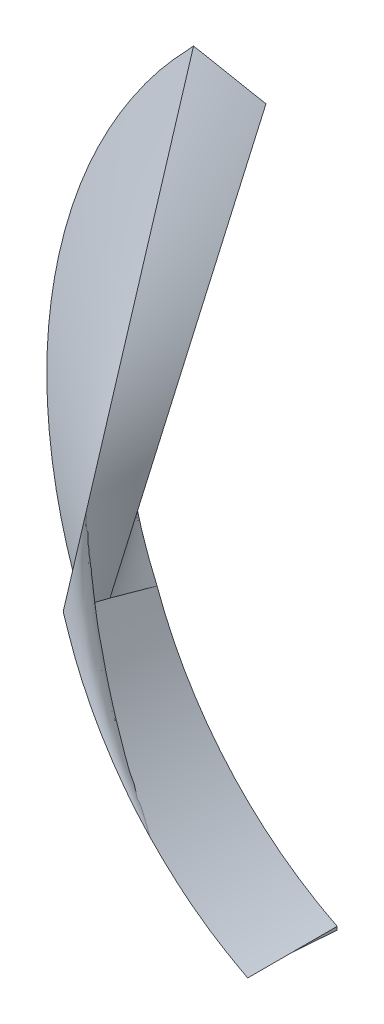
ISO-10303-21;
HEADER;
FILE_DESCRIPTION(('STEP AP214'),'2;1');
FILE_NAME('part.step','',(''),(''),'','','');
FILE_SCHEMA(('AUTOMOTIVE_DESIGN { 1 0 10303 214 1 1 1 1 }'));
ENDSEC;
DATA;
#1=APPLICATION_CONTEXT('core data for automotive mechanical design processes');
#2=APPLICATION_PROTOCOL_DEFINITION('international standard','automotive_design',2000,#1);
#3=PRODUCT_CONTEXT('',#1,'mechanical');
#4=PRODUCT('Part','Part','',(#3));
#5=PRODUCT_RELATED_PRODUCT_CATEGORY('part','',(#4));
#6=PRODUCT_DEFINITION_FORMATION('','',#4);
#7=PRODUCT_DEFINITION_CONTEXT('part definition',#1,'design');
#8=PRODUCT_DEFINITION('design','',#6,#7);
#9=PRODUCT_DEFINITION_SHAPE('','',#8);
#10=(LENGTH_UNIT() NAMED_UNIT(*) SI_UNIT(.MILLI.,.METRE.));
#11=(NAMED_UNIT(*) PLANE_ANGLE_UNIT() SI_UNIT($,.RADIAN.));
#12=(NAMED_UNIT(*) SI_UNIT($,.STERADIAN.) SOLID_ANGLE_UNIT());
#13=UNCERTAINTY_MEASURE_WITH_UNIT(LENGTH_MEASURE(1.E-05),#10,'distance_accuracy_value','');
#14=(GEOMETRIC_REPRESENTATION_CONTEXT(3) GLOBAL_UNCERTAINTY_ASSIGNED_CONTEXT((#13)) GLOBAL_UNIT_ASSIGNED_CONTEXT((#10,
#11,#12)) REPRESENTATION_CONTEXT('',''));
#15=CARTESIAN_POINT('',(0.,0.,0.));
#16=DIRECTION('',(0.,0.,1.));
#17=DIRECTION('',(1.,0.,0.));
#18=AXIS2_PLACEMENT_3D('',#15,#16,#17);
#19=CARTESIAN_POINT('',(-28.2525641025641,-60.4671431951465,22.6547696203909));
#20=DIRECTION('',(0.,0.,-1.));
#21=DIRECTION('',(-1.,0.,0.));
#22=AXIS2_PLACEMENT_3D('',#19,#20,#21);
#23=CYLINDRICAL_SURFACE('',#22,17.5);
#24=CARTESIAN_POINT('',(-35.7525641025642,-76.2785314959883,7.35833424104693));
#25=DIRECTION('',(0.,0.,-1.));
#26=VECTOR('',#25,1.);
#27=LINE('',#24,#26);
#28=CARTESIAN_POINT('',(-35.7525641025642,-76.2785314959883,7.35833424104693));
#29=VERTEX_POINT('',#28);
#30=CARTESIAN_POINT('',(-35.7525641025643,-76.2785314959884,5.28894384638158));
#31=VERTEX_POINT('',#30);
#32=EDGE_CURVE('E137',#29,#31,#27,.T.);
#33=ORIENTED_EDGE('',*,*,#32,.T.);
#34=CARTESIAN_POINT('',(-28.2525641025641,-60.4671431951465,4.69415557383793));
#35=DIRECTION('',(0.,0.03759112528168,0.999293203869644));
#36=DIRECTION('',(0.,0.999293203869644,-0.03759112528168));
#37=AXIS2_PLACEMENT_3D('',#34,#35,#36);
#38=ELLIPSE('',#37,17.5123776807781,17.5);
#39=CARTESIAN_POINT('',(-44.4232075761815,-67.157456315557,4.94582985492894));
#40=VERTEX_POINT('',#39);
#41=EDGE_CURVE('E147',#40,#31,#38,.T.);
#42=ORIENTED_EDGE('',*,*,#41,.F.);
#43=CARTESIAN_POINT('',(-44.5950370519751,-66.7261290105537,6.95222047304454));
#44=CARTESIAN_POINT('',(-44.5774687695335,-66.7720009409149,6.72874549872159));
#45=CARTESIAN_POINT('',(-44.5413787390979,-66.8650621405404,6.28214180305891));
#46=CARTESIAN_POINT('',(-44.4841959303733,-67.0087605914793,5.61332162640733));
#47=CARTESIAN_POINT('',(-44.4439173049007,-67.1074004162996,5.16819615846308));
#48=CARTESIAN_POINT('',(-44.4232075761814,-67.1574563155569,4.94582985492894));
#49=B_SPLINE_CURVE_WITH_KNOTS('',3,(#43,#44,#45,#46,#47,#48),.UNSPECIFIED.,.F.,.F.,(4,1,1,4),
(0.5,0.666666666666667,0.833333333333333,1.),.UNSPECIFIED.);
#50=CARTESIAN_POINT('',(-44.5950193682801,-66.7261222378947,6.95222047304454));
#51=VERTEX_POINT('',#50);
#52=EDGE_CURVE('E258',#51,#40,#49,.T.);
#53=ORIENTED_EDGE('',*,*,#52,.F.);
#54=CARTESIAN_POINT('',(-44.7411229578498,-66.3303698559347,8.96795992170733));
#55=CARTESIAN_POINT('',(-44.7261340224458,-66.3725217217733,8.74351610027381));
#56=CARTESIAN_POINT('',(-44.6953900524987,-66.4579881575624,8.29492810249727));
#57=CARTESIAN_POINT('',(-44.6467884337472,-66.5898305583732,7.62299164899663));
#58=CARTESIAN_POINT('',(-44.6126053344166,-66.6802570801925,7.1756954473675));
#59=CARTESIAN_POINT('',(-44.5950370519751,-66.7261290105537,6.95222047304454));
#60=B_SPLINE_CURVE_WITH_KNOTS('',3,(#54,#55,#56,#57,#58,#59),.UNSPECIFIED.,.F.,.F.,(4,1,1,4),
(0.,0.166666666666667,0.333333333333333,0.5),.UNSPECIFIED.);
#61=CARTESIAN_POINT('',(-44.7411229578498,-66.3303698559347,8.96795992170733));
#62=VERTEX_POINT('',#61);
#63=EDGE_CURVE('E282',#62,#51,#60,.T.);
#64=ORIENTED_EDGE('',*,*,#63,.F.);
#65=CARTESIAN_POINT('',(-35.7525641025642,-76.2785314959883,9.42772463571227));
#66=CARTESIAN_POINT('',(-36.0030285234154,-76.1508503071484,9.42182371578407));
#67=CARTESIAN_POINT('',(-36.5157903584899,-75.8894557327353,9.40974309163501));
#68=CARTESIAN_POINT('',(-37.2719991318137,-75.4727841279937,9.3904861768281));
#69=CARTESIAN_POINT('',(-37.8240856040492,-75.1209371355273,9.37422519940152));
#70=CARTESIAN_POINT('',(-38.1745551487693,-74.8812334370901,9.36314704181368));
#71=CARTESIAN_POINT('',(-38.3402314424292,-74.7650066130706,9.35777549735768));
#72=CARTESIAN_POINT('',(-38.5047807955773,-74.6467443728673,9.35230988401));
#73=CARTESIAN_POINT('',(-38.8454268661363,-74.3961909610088,9.34073029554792));
#74=CARTESIAN_POINT('',(-39.3536967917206,-74.0001261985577,9.32242574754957));
#75=CARTESIAN_POINT('',(-39.9019610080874,-73.5292817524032,9.30066517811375));
#76=CARTESIAN_POINT('',(-40.3269605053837,-73.1354720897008,9.28246485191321));
#77=CARTESIAN_POINT('',(-40.6384707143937,-72.8318758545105,9.26843383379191));
#78=CARTESIAN_POINT('',(-40.9425743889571,-72.5201088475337,9.25402519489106));
#79=CARTESIAN_POINT('',(-41.2387078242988,-72.2006497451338,9.23926105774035));
#80=CARTESIAN_POINT('',(-41.5266619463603,-71.8735984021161,9.22414603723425));
#81=CARTESIAN_POINT('',(-41.8059994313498,-71.5395299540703,9.20870671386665));
#82=CARTESIAN_POINT('',(-42.0766255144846,-71.1987724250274,9.19295824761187));
#83=CARTESIAN_POINT('',(-42.4256072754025,-70.7362820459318,9.17158377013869));
#84=CARTESIAN_POINT('',(-42.8388141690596,-70.1429692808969,9.14416319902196));
#85=CARTESIAN_POINT('',(-43.1812570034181,-69.59740600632,9.11894942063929));
#86=CARTESIAN_POINT('',(-43.3960555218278,-69.2331648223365,9.10211563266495));
#87=CARTESIAN_POINT('',(-43.4969133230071,-69.057775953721,9.09400985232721));
#88=CARTESIAN_POINT('',(-43.604161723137,-68.8662541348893,9.08515847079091));
#89=CARTESIAN_POINT('',(-43.8132464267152,-68.4809028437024,9.06734905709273));
#90=CARTESIAN_POINT('',(-44.1054485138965,-67.8953705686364,9.04028806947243));
#91=CARTESIAN_POINT('',(-44.4361401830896,-67.1162192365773,9.00427877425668));
#92=CARTESIAN_POINT('',(-44.639444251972,-66.5923654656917,8.98006832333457));
#93=CARTESIAN_POINT('',(-44.7411229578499,-66.3303698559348,8.96795992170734));
#94=B_SPLINE_CURVE_WITH_KNOTS('',3,(#65,#66,#67,#68,#69,#70,#71,#72,#73,#74,#75,#76,#77,#78,#79,
#80,#81,#82,#83,#84,#85,#86,#87,#88,#89,#90,#91,#92,#93),.UNSPECIFIED.,.F.,.F.,(4,1,1,1,1,1,1,1,
1,1,1,1,1,1,1,1,1,1,1,1,1,1,1,1,1,1,4),(0.,0.0625220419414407,0.127997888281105,
0.191230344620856,0.205922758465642,0.220615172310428,0.235307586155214,0.25,0.3125,0.375,
0.406216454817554,0.4375,0.468738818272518,0.5,0.531261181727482,0.562522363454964,
0.593783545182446,0.625044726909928,0.6875,0.750068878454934,0.764692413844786,
0.779384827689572,0.794077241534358,0.8125,0.875032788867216,0.9375,1.),.UNSPECIFIED.);
#95=CARTESIAN_POINT('',(-35.7525641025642,-76.2785314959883,9.42772463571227));
#96=VERTEX_POINT('',#95);
#97=EDGE_CURVE('E123',#96,#62,#94,.T.);
#98=ORIENTED_EDGE('',*,*,#97,.F.);
#99=CARTESIAN_POINT('',(-35.7525641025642,-76.2785314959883,7.35833424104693));
#100=CARTESIAN_POINT('',(-35.7525641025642,-76.2785314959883,7.58826650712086));
#101=CARTESIAN_POINT('',(-35.7525641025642,-76.2785314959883,8.04813103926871));
#102=CARTESIAN_POINT('',(-35.7525641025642,-76.2785314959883,8.73792783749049));
#103=CARTESIAN_POINT('',(-35.7525641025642,-76.2785314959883,9.19779236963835));
#104=CARTESIAN_POINT('',(-35.7525641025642,-76.2785314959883,9.42772463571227));
#105=B_SPLINE_CURVE_WITH_KNOTS('',3,(#99,#100,#101,#102,#103,#104),.UNSPECIFIED.,.F.,.F.,(4,1,1,
4),(0.,0.166666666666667,0.333333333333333,0.5),.UNSPECIFIED.);
#106=EDGE_CURVE('E141',#96,#29,#105,.F.);
#107=ORIENTED_EDGE('',*,*,#106,.T.);
#108=EDGE_LOOP('',(#33,#42,#53,#64,#98,#107));
#109=FACE_BOUND('',#108,.T.);
#110=ADVANCED_FACE('F103',(#109),#23,.F.);
#111=CARTESIAN_POINT('',(-35.7525641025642,-76.2785314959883,9.42772463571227));
#112=CARTESIAN_POINT('',(-35.7525641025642,-76.2785314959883,9.19779236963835));
#113=CARTESIAN_POINT('',(-35.7525641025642,-76.2785314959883,8.73792783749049));
#114=CARTESIAN_POINT('',(-35.7525641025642,-76.2785314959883,8.04813103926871));
#115=CARTESIAN_POINT('',(-35.7525641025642,-76.2785314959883,7.58826650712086));
#116=CARTESIAN_POINT('',(-35.7525641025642,-76.2785314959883,7.35833424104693));
#117=CARTESIAN_POINT('',(-42.8181753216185,-76.4318356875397,5.29471079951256));
#118=CARTESIAN_POINT('',(-42.0331074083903,-76.4318356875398,5.29471079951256));
#119=CARTESIAN_POINT('',(-40.4629715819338,-76.4318356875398,5.29471079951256));
#120=CARTESIAN_POINT('',(-38.107767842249,-76.4318356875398,5.29471079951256));
#121=CARTESIAN_POINT('',(-36.5376320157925,-76.4318356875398,5.29471079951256));
#122=CARTESIAN_POINT('',(-35.7525641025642,-76.4318356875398,5.29471079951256));
#123=B_SPLINE_SURFACE_WITH_KNOTS('',1,3,((#111,#112,#113,#114,#115,#116),(#117,#118,#119,#120,
#121,#122)),.UNSPECIFIED.,.F.,.F.,.F.,(2,2),(4,1,1,4),(0.,1.),(0.,0.166666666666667,
0.333333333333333,0.5),.UNSPECIFIED.);
#124=DIRECTION('',(0.863020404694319,0.0187251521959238,0.504821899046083));
#125=VECTOR('',#124,1.);
#126=CARTESIAN_POINT('',(-39.2853697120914,-76.355183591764,7.36121771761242));
#127=LINE('',#126,#125);
#128=CARTESIAN_POINT('',(-42.8181753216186,-76.4318356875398,5.29471079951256));
#129=VERTEX_POINT('',#128);
#130=EDGE_CURVE('E377',#129,#96,#127,.T.);
#131=CARTESIAN_POINT('',(-42.8181753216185,-76.4318356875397,5.29471079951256));
#132=CARTESIAN_POINT('',(-42.0331074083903,-76.4318356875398,5.29471079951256));
#133=CARTESIAN_POINT('',(-40.4629715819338,-76.4318356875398,5.29471079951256));
#134=CARTESIAN_POINT('',(-38.107767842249,-76.4318356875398,5.29471079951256));
#135=CARTESIAN_POINT('',(-36.5376320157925,-76.4318356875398,5.29471079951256));
#136=CARTESIAN_POINT('',(-35.7525641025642,-76.4318356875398,5.29471079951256));
#137=B_SPLINE_CURVE_WITH_KNOTS('',3,(#131,#132,#133,#134,#135,#136),.UNSPECIFIED.,.F.,.F.,(4,1,
1,4),(0.,0.166666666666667,0.333333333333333,0.5),.UNSPECIFIED.);
#138=CARTESIAN_POINT('',(-35.7525641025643,-76.4318356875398,5.29471079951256));
#139=VERTEX_POINT('',#138);
#140=EDGE_CURVE('E164',#129,#139,#137,.T.);
#141=CARTESIAN_POINT('',(-35.7525641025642,-76.4318356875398,5.29471079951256));
#142=CARTESIAN_POINT('',(-35.7525641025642,-76.2785314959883,7.35833424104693));
#143=B_SPLINE_CURVE_WITH_KNOTS('',1,(#141,#142),.UNSPECIFIED.,.F.,.F.,(2,2),(0.,1.),.UNSPECIFIED.);
#144=EDGE_CURVE('E153',#29,#139,#143,.F.);
#145=ORIENTED_EDGE('',*,*,#130,.F.);
#146=ORIENTED_EDGE('',*,*,#140,.T.);
#147=ORIENTED_EDGE('',*,*,#144,.F.);
#148=ORIENTED_EDGE('',*,*,#106,.F.);
#149=EDGE_LOOP('',(#145,#146,#147,#148));
#150=FACE_BOUND('',#149,.T.);
#151=ADVANCED_FACE('F162',(#150),#123,.T.);
#152=CARTESIAN_POINT('',(-35.7525641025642,-76.2785314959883,7.35833424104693));
#153=DIRECTION('',(1.,0.,0.));
#154=DIRECTION('',(0.,-0.0740846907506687,-0.997251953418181));
#155=AXIS2_PLACEMENT_3D('',#152,#153,#154);
#156=PLANE('',#155);
#157=ORIENTED_EDGE('',*,*,#144,.T.);
#158=CARTESIAN_POINT('',(-35.7525641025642,-76.4318356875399,5.29471079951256));
#159=DIRECTION('',(0.,0.999293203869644,-0.0375911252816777));
#160=VECTOR('',#159,1.);
#161=LINE('',#158,#160);
#162=EDGE_CURVE('E156',#139,#31,#161,.T.);
#163=ORIENTED_EDGE('',*,*,#162,.T.);
#164=ORIENTED_EDGE('',*,*,#32,.F.);
#165=EDGE_LOOP('',(#157,#163,#164));
#166=FACE_BOUND('',#165,.T.);
#167=ADVANCED_FACE('F105',(#166),#156,.T.);
#168=CARTESIAN_POINT('',(19.3167969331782,144.825406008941,-3.0284806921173));
#169=DIRECTION('',(0.,0.03759112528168,0.999293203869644));
#170=DIRECTION('',(0.,-0.999293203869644,0.03759112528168));
#171=AXIS2_PLACEMENT_3D('',#168,#169,#170);
#172=PLANE('',#171);
#173=CARTESIAN_POINT('',(-43.5512841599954,-45.5112452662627,4.13154889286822));
#174=CARTESIAN_POINT('',(-43.7072568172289,-45.6777455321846,4.13781225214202));
#175=CARTESIAN_POINT('',(-43.8632202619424,-45.8443284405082,4.144078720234));
#176=CARTESIAN_POINT('',(-44.1727621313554,-46.1798571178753,4.15670054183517));
#177=CARTESIAN_POINT('',(-44.3263391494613,-46.3488041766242,4.16305594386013));
#178=CARTESIAN_POINT('',(-44.5530568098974,-46.6055667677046,4.17271476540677));
#179=CARTESIAN_POINT('',(-44.6280470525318,-46.6917421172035,4.17595648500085));
#180=CARTESIAN_POINT('',(-44.7764774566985,-46.8654157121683,4.18248968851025));
#181=CARTESIAN_POINT('',(-44.8499176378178,-46.9529139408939,4.18578117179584));
#182=CARTESIAN_POINT('',(-44.9950132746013,-47.1293386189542,4.19241786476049));
#183=CARTESIAN_POINT('',(-45.0666691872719,-47.2182646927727,4.19576306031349));
#184=CARTESIAN_POINT('',(-45.2083181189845,-47.397429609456,4.20250283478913));
#185=CARTESIAN_POINT('',(-45.2783111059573,-47.4876684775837,4.20589741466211));
#186=CARTESIAN_POINT('',(-45.4859167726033,-47.7602742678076,4.21615222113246));
#187=CARTESIAN_POINT('',(-45.6211169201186,-47.9444824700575,4.22308171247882));
#188=CARTESIAN_POINT('',(-45.8855924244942,-48.3171329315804,4.23709997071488));
#189=CARTESIAN_POINT('',(-46.014866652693,-48.5055759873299,4.24418876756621));
#190=CARTESIAN_POINT('',(-46.267810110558,-48.8862041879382,4.25850713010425));
#191=CARTESIAN_POINT('',(-46.3914789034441,-49.0783896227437,4.2657367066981));
#192=CARTESIAN_POINT('',(-46.6328514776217,-49.4664417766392,4.28033434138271));
#193=CARTESIAN_POINT('',(-46.7505558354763,-49.6623081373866,4.28770238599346));
#194=CARTESIAN_POINT('',(-46.9797297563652,-50.0576197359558,4.30257310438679));
#195=CARTESIAN_POINT('',(-47.0912001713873,-50.2570644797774,4.31007575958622));
#196=CARTESIAN_POINT('',(-47.3076585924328,-50.6594391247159,4.32521217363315));
#197=CARTESIAN_POINT('',(-47.4126462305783,-50.8623692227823,4.33284593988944));
#198=CARTESIAN_POINT('',(-47.7176311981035,-51.4759733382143,4.35592832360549));
#199=CARTESIAN_POINT('',(-47.9077455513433,-51.891624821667,4.37156418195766));
#200=CARTESIAN_POINT('',(-48.2098995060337,-52.6139807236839,4.39873755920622));
#201=CARTESIAN_POINT('',(-48.3287259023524,-52.9178790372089,4.41016951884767));
#202=CARTESIAN_POINT('',(-48.5522793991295,-53.5308168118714,4.43322683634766));
#203=CARTESIAN_POINT('',(-48.6570053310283,-53.839856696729,4.4448522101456));
#204=CARTESIAN_POINT('',(-48.9499515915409,-54.7738063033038,4.4799852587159));
#205=CARTESIAN_POINT('',(-49.1169440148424,-55.4055546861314,4.50375018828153));
#206=CARTESIAN_POINT('',(-49.3245277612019,-56.3612909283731,4.5397028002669));
#207=CARTESIAN_POINT('',(-49.386523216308,-56.6808373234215,4.55172340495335));
#208=CARTESIAN_POINT('',(-49.4962669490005,-57.32237499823,4.57585658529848));
#209=CARTESIAN_POINT('',(-49.5440147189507,-57.644366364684,4.58796916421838));
#210=CARTESIAN_POINT('',(-49.6655205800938,-58.6127278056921,4.62439670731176));
#211=CARTESIAN_POINT('',(-49.7176560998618,-59.2620133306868,4.64882134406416));
#212=CARTESIAN_POINT('',(-49.7502217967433,-60.2115584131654,4.68454105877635));
#213=CARTESIAN_POINT('',(-49.7541588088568,-60.5112185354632,4.69581358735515));
#214=CARTESIAN_POINT('',(-49.7490576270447,-61.1103827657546,4.71835277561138));
#215=CARTESIAN_POINT('',(-49.7400227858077,-61.4098868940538,4.72961943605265));
#216=CARTESIAN_POINT('',(-49.7090927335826,-62.0082183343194,4.75212729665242));
#217=CARTESIAN_POINT('',(-49.6871977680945,-62.3070456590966,4.76336849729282));
#218=CARTESIAN_POINT('',(-49.6308567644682,-62.903577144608,4.78580864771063));
#219=CARTESIAN_POINT('',(-49.5964074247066,-63.2012809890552,4.79700758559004));
#220=CARTESIAN_POINT('',(-49.4735187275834,-64.0993513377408,4.83079093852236));
#221=CARTESIAN_POINT('',(-49.3659313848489,-64.6972007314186,4.85328066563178));
#222=CARTESIAN_POINT('',(-49.1016267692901,-65.8821713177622,4.89785654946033));
#223=CARTESIAN_POINT('',(-48.9448917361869,-66.4692885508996,4.91994255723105));
#224=CARTESIAN_POINT('',(-48.6733846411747,-67.3391219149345,4.95266369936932));
#225=CARTESIAN_POINT('',(-48.5766872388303,-67.6275733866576,4.96351458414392));
#226=CARTESIAN_POINT('',(-48.3711608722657,-68.2001520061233,4.98505368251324));
#227=CARTESIAN_POINT('',(-48.2623318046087,-68.4842791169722,4.99574189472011));
#228=CARTESIAN_POINT('',(-48.0326045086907,-69.0475769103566,5.01693186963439));
#229=CARTESIAN_POINT('',(-47.9117077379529,-69.3267481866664,5.02743365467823));
#230=CARTESIAN_POINT('',(-47.657743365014,-69.8794979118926,5.04822683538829));
#231=CARTESIAN_POINT('',(-47.5246764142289,-70.1530766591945,5.05851824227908));
#232=CARTESIAN_POINT('',(-47.2896044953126,-70.6110987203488,5.0757479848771));
#233=CARTESIAN_POINT('',(-47.1906197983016,-70.7970989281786,5.08274488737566));
#234=CARTESIAN_POINT('',(-46.9872197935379,-71.1661050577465,5.09662605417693));
#235=CARTESIAN_POINT('',(-46.8828047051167,-71.3491111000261,5.10351032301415));
#236=CARTESIAN_POINT('',(-46.6685261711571,-71.7119597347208,5.11715985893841));
#237=CARTESIAN_POINT('',(-46.558661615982,-71.8918016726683,5.1239251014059));
#238=CARTESIAN_POINT('',(-46.3336866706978,-72.248173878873,5.13733100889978));
#239=CARTESIAN_POINT('',(-46.2185763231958,-72.4247041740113,5.1439716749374));
#240=CARTESIAN_POINT('',(-45.983358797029,-72.7744220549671,5.15712726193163));
#241=CARTESIAN_POINT('',(-45.8632513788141,-72.9476094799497,5.16364217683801));
#242=CARTESIAN_POINT('',(-45.6795339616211,-73.2048467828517,5.17331885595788));
#243=CARTESIAN_POINT('',(-45.6177011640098,-73.2901698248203,5.1765285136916));
#244=CARTESIAN_POINT('',(-45.4928805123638,-73.4599679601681,5.18291593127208));
#245=CARTESIAN_POINT('',(-45.4298926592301,-73.5444430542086,5.18609369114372));
#246=CARTESIAN_POINT('',(-45.2391109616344,-73.7965664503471,5.19557799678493));
#247=CARTESIAN_POINT('',(-45.1095293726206,-73.9628702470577,5.20183396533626));
#248=CARTESIAN_POINT('',(-44.8453226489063,-74.291389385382,5.2141921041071));
#249=CARTESIAN_POINT('',(-44.7106984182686,-74.4536054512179,5.22029430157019));
#250=CARTESIAN_POINT('',(-44.5047409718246,-74.6934457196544,5.22931654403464));
#251=CARTESIAN_POINT('',(-44.4354248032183,-74.7728047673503,5.23230184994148));
#252=CARTESIAN_POINT('',(-44.2953882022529,-74.9302750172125,5.23822552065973));
#253=CARTESIAN_POINT('',(-44.2246677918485,-75.0083862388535,5.24116388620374));
#254=CARTESIAN_POINT('',(-44.0103842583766,-75.2408329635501,5.24990800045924));
#255=CARTESIAN_POINT('',(-43.8647302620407,-75.3932448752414,5.25564138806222));
#256=CARTESIAN_POINT('',(-43.5698093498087,-75.6943381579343,5.26696782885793));
#257=CARTESIAN_POINT('',(-43.4205443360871,-75.8430214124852,5.27256095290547));
#258=CARTESIAN_POINT('',(-43.1202474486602,-76.138430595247,5.2836735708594));
#259=CARTESIAN_POINT('',(-42.9692166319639,-76.2851575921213,5.28919310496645));
#260=CARTESIAN_POINT('',(-42.8181753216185,-76.4318356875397,5.29471079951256));
#261=B_SPLINE_CURVE_WITH_KNOTS('',3,(#173,#174,#175,#176,#177,#178,#179,#180,#181,#182,#183,
#184,#185,#186,#187,#188,#189,#190,#191,#192,#193,#194,#195,#196,#197,#198,#199,#200,#201,#202,
#203,#204,#205,#206,#207,#208,#209,#210,#211,#212,#213,#214,#215,#216,#217,#218,#219,#220,#221,
#222,#223,#224,#225,#226,#227,#228,#229,#230,#231,#232,#233,#234,#235,#236,#237,#238,#239,#240,
#241,#242,#243,#244,#245,#246,#247,#248,#249,#250,#251,#252,#253,#254,#255,#256,#257,#258,#259,
#260),.UNSPECIFIED.,.F.,.F.,(4,2,2,2,2,2,2,2,2,2,2,2,2,2,2,2,2,2,2,2,2,2,2,2,2,2,2,2,2,2,2,2,2,
2,2,2,2,2,2,2,2,2,2,4),(0.,0.684784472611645,1.36995832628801,1.71278587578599,2.0556090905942,
2.39834357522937,2.7410846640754,3.42675258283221,4.11255055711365,4.79840187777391,
5.48418677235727,6.1698777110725,6.85560752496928,8.22650025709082,9.2056762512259,
10.1849333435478,12.1434193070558,13.1203425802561,14.0973006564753,16.0495998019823,
16.9490905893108,17.848348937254,18.7475901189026,19.6470679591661,21.4684264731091,
23.2904439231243,24.2034816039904,25.1165270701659,26.029462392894,26.9423488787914,
27.5747113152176,28.2070482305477,28.8395144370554,29.4719755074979,30.1044669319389,
30.420722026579,30.736976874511,31.3696436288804,32.002197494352,32.3184168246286,
32.6346312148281,33.2672048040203,33.8994521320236,34.531338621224),.UNSPECIFIED.);
#262=CARTESIAN_POINT('',(-43.5512841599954,-45.5112452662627,4.13154889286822));
#263=VERTEX_POINT('',#262);
#264=EDGE_CURVE('E114',#263,#129,#261,.T.);
#265=ORIENTED_EDGE('',*,*,#264,.F.);
#266=CARTESIAN_POINT('',(-40.1797824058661,-46.1285270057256,4.15476962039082));
#267=CARTESIAN_POINT('',(-40.5543937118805,-46.0599401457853,4.15218953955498));
#268=CARTESIAN_POINT('',(-41.3036163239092,-45.9227664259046,4.14702937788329));
#269=CARTESIAN_POINT('',(-42.4274502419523,-45.7170058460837,4.13928913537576));
#270=CARTESIAN_POINT('',(-43.176672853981,-45.579832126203,4.13412897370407));
#271=CARTESIAN_POINT('',(-43.5512841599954,-45.5112452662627,4.13154889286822));
#272=B_SPLINE_CURVE_WITH_KNOTS('',3,(#266,#267,#268,#269,#270,#271),.UNSPECIFIED.,.F.,.F.,(4,1,
1,4),(0.,0.166666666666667,0.333333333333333,0.5),.UNSPECIFIED.);
#273=CARTESIAN_POINT('',(-40.1797824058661,-46.1285270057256,4.15476962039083));
#274=VERTEX_POINT('',#273);
#275=EDGE_CURVE('E302',#263,#274,#272,.F.);
#276=ORIENTED_EDGE('',*,*,#275,.T.);
#277=CARTESIAN_POINT('',(-44.4232075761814,-67.1574563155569,4.94582985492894));
#278=CARTESIAN_POINT('',(-45.6092464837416,-64.773202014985,4.85613966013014));
#279=CARTESIAN_POINT('',(-46.8022853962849,-59.6696880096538,4.66415713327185));
#280=CARTESIAN_POINT('',(-45.2767825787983,-52.1098302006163,4.37977256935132));
#281=CARTESIAN_POINT('',(-42.1977769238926,-47.867153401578,4.22017276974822));
#282=CARTESIAN_POINT('',(-40.1797824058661,-46.1285270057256,4.15476962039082));
#283=B_SPLINE_CURVE_WITH_KNOTS('',3,(#277,#278,#279,#280,#281,#282),.UNSPECIFIED.,.F.,.F.,(4,1,
1,4),(0.5,0.666666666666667,0.833333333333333,1.),.UNSPECIFIED.);
#284=EDGE_CURVE('E278',#274,#40,#283,.F.);
#285=ORIENTED_EDGE('',*,*,#284,.T.);
#286=ORIENTED_EDGE('',*,*,#41,.T.);
#287=ORIENTED_EDGE('',*,*,#162,.F.);
#288=ORIENTED_EDGE('',*,*,#140,.F.);
#289=EDGE_LOOP('',(#265,#276,#285,#286,#287,#288));
#290=FACE_BOUND('',#289,.T.);
#291=ADVANCED_FACE('F184',(#290),#172,.F.);
#292=CARTESIAN_POINT('',(-44.7411229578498,-66.3303698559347,8.96795992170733));
#293=CARTESIAN_POINT('',(-44.7261340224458,-66.3725217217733,8.74351610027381));
#294=CARTESIAN_POINT('',(-44.6953900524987,-66.4579881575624,8.29492810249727));
#295=CARTESIAN_POINT('',(-44.6467884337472,-66.5898305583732,7.62299164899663));
#296=CARTESIAN_POINT('',(-44.6126053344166,-66.6802570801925,7.1756954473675));
#297=CARTESIAN_POINT('',(-44.5950370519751,-66.7261290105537,6.95222047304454));
#298=CARTESIAN_POINT('',(-43.5512841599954,-45.5112452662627,4.13154889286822));
#299=CARTESIAN_POINT('',(-43.176672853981,-45.579832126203,4.13412897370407));
#300=CARTESIAN_POINT('',(-42.4274502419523,-45.7170058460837,4.13928913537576));
#301=CARTESIAN_POINT('',(-41.3036163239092,-45.9227664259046,4.14702937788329));
#302=CARTESIAN_POINT('',(-40.5543937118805,-46.0599401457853,4.15218953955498));
#303=CARTESIAN_POINT('',(-40.1797824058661,-46.1285270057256,4.15476962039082));
#304=B_SPLINE_SURFACE_WITH_KNOTS('',1,3,((#292,#293,#294,#295,#296,#297),(#298,#299,#300,#301,
#302,#303)),.UNSPECIFIED.,.F.,.F.,.F.,(2,2),(4,1,1,4),(0.,1.),(0.,0.166666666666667,
0.333333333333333,0.5),.UNSPECIFIED.);
#305=DIRECTION('',(0.0555828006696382,0.972556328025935,-0.22593083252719));
#306=VECTOR('',#305,1.);
#307=CARTESIAN_POINT('',(-44.1462035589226,-55.9208075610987,6.54975440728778));
#308=LINE('',#307,#306);
#309=EDGE_CURVE('E12',#62,#263,#308,.T.);
#310=CARTESIAN_POINT('',(-44.5950370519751,-66.7261290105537,6.95222047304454));
#311=CARTESIAN_POINT('',(-40.1797824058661,-46.1285270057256,4.15476962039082));
#312=B_SPLINE_CURVE_WITH_KNOTS('',1,(#310,#311),.UNSPECIFIED.,.F.,.F.,(2,2),(0.,1.),.UNSPECIFIED.);
#313=EDGE_CURVE('E268',#51,#274,#312,.T.);
#314=ORIENTED_EDGE('',*,*,#309,.F.);
#315=ORIENTED_EDGE('',*,*,#63,.T.);
#316=ORIENTED_EDGE('',*,*,#313,.T.);
#317=ORIENTED_EDGE('',*,*,#275,.F.);
#318=EDGE_LOOP('',(#314,#315,#316,#317));
#319=FACE_BOUND('',#318,.T.);
#320=ADVANCED_FACE('F210',(#319),#304,.F.);
#321=CARTESIAN_POINT('',(-44.5950370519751,-66.7261290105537,6.95222047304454));
#322=CARTESIAN_POINT('',(-44.5774687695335,-66.7720009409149,6.72874549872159));
#323=CARTESIAN_POINT('',(-44.5413787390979,-66.8650621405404,6.28214180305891));
#324=CARTESIAN_POINT('',(-44.4841959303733,-67.0087605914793,5.61332162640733));
#325=CARTESIAN_POINT('',(-44.4439173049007,-67.1074004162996,5.16819615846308));
#326=CARTESIAN_POINT('',(-44.4232075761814,-67.1574563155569,4.94582985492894));
#327=CARTESIAN_POINT('',(-40.1797824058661,-46.1285270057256,4.15476962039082));
#328=CARTESIAN_POINT('',(-42.1977769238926,-47.867153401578,4.22017276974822));
#329=CARTESIAN_POINT('',(-45.2767825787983,-52.1098302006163,4.37977256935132));
#330=CARTESIAN_POINT('',(-46.8022853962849,-59.6696880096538,4.66415713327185));
#331=CARTESIAN_POINT('',(-45.6092464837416,-64.773202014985,4.85613966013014));
#332=CARTESIAN_POINT('',(-44.4232075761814,-67.1574563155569,4.94582985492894));
#333=B_SPLINE_SURFACE_WITH_KNOTS('',1,3,((#321,#322,#323,#324,#325,#326),(#327,#328,#329,#330,
#331,#332)),.UNSPECIFIED.,.F.,.F.,.F.,(2,2),(4,1,1,4),(0.,1.),(0.5,0.666666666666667,
0.833333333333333,1.),.UNSPECIFIED.);
#334=ORIENTED_EDGE('',*,*,#313,.F.);
#335=ORIENTED_EDGE('',*,*,#52,.T.);
#336=ORIENTED_EDGE('',*,*,#284,.F.);
#337=EDGE_LOOP('',(#334,#335,#336));
#338=FACE_BOUND('',#337,.T.);
#339=ADVANCED_FACE('F221',(#338),#333,.F.);
#340=CARTESIAN_POINT('',(-44.7411229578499,-66.3303698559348,8.96795992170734));
#341=CARTESIAN_POINT('',(-44.639444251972,-66.5923654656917,8.98006832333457));
#342=CARTESIAN_POINT('',(-44.4361401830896,-67.1162192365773,9.00427877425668));
#343=CARTESIAN_POINT('',(-44.1054485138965,-67.8953705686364,9.04028806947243));
#344=CARTESIAN_POINT('',(-43.8132464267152,-68.4809028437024,9.06734905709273));
#345=CARTESIAN_POINT('',(-43.604161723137,-68.8662541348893,9.08515847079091));
#346=CARTESIAN_POINT('',(-43.4969133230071,-69.057775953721,9.09400985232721));
#347=CARTESIAN_POINT('',(-43.3960555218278,-69.2331648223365,9.10211563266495));
#348=CARTESIAN_POINT('',(-43.1812570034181,-69.59740600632,9.11894942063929));
#349=CARTESIAN_POINT('',(-42.8388141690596,-70.1429692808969,9.14416319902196));
#350=CARTESIAN_POINT('',(-42.4256072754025,-70.7362820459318,9.17158377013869));
#351=CARTESIAN_POINT('',(-42.0766255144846,-71.1987724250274,9.19295824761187));
#352=CARTESIAN_POINT('',(-41.8059994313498,-71.5395299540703,9.20870671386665));
#353=CARTESIAN_POINT('',(-41.5266619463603,-71.8735984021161,9.22414603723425));
#354=CARTESIAN_POINT('',(-41.2387078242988,-72.2006497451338,9.23926105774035));
#355=CARTESIAN_POINT('',(-40.9425743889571,-72.5201088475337,9.25402519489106));
#356=CARTESIAN_POINT('',(-40.6384707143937,-72.8318758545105,9.26843383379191));
#357=CARTESIAN_POINT('',(-40.3269605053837,-73.1354720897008,9.28246485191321));
#358=CARTESIAN_POINT('',(-39.9019610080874,-73.5292817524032,9.30066517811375));
#359=CARTESIAN_POINT('',(-39.3536967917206,-74.0001261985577,9.32242574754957));
#360=CARTESIAN_POINT('',(-38.8454268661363,-74.3961909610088,9.34073029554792));
#361=CARTESIAN_POINT('',(-38.5047807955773,-74.6467443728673,9.35230988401));
#362=CARTESIAN_POINT('',(-38.3402314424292,-74.7650066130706,9.35777549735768));
#363=CARTESIAN_POINT('',(-38.1745551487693,-74.8812334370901,9.36314704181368));
#364=CARTESIAN_POINT('',(-37.8240856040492,-75.1209371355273,9.37422519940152));
#365=CARTESIAN_POINT('',(-37.2719991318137,-75.4727841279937,9.3904861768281));
#366=CARTESIAN_POINT('',(-36.5157903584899,-75.8894557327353,9.40974309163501));
#367=CARTESIAN_POINT('',(-36.0030285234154,-76.1508503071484,9.42182371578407));
#368=CARTESIAN_POINT('',(-35.7525641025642,-76.2785314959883,9.42772463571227));
#369=CARTESIAN_POINT('',(-44.3445100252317,-59.3906616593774,7.3558229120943));
#370=CARTESIAN_POINT('',(-44.4253387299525,-59.7240217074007,7.36986497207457));
#371=CARTESIAN_POINT('',(-44.5869537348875,-60.3905669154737,7.39794172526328));
#372=CARTESIAN_POINT('',(-44.7724029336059,-61.4595171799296,7.44261945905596));
#373=CARTESIAN_POINT('',(-44.8562486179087,-62.3076245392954,7.47787972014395));
#374=CARTESIAN_POINT('',(-44.885142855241,-62.8865844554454,7.50186778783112));
#375=CARTESIAN_POINT('',(-44.8939591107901,-63.1785553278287,7.51394891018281));
#376=CARTESIAN_POINT('',(-44.8974135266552,-63.4493468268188,7.52514083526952));
#377=CARTESIAN_POINT('',(-44.8947797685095,-64.0187527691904,7.54864849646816));
#378=CARTESIAN_POINT('',(-44.8508259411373,-64.8994736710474,7.58490649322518));
#379=CARTESIAN_POINT('',(-44.723258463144,-65.9015094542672,7.6260017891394));
#380=CARTESIAN_POINT('',(-44.5717340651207,-66.7058443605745,7.65891012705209));
#381=CARTESIAN_POINT('',(-44.4329939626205,-67.3093720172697,7.68356675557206));
#382=CARTESIAN_POINT('',(-44.2686360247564,-67.9112295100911,7.70812221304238));
#383=CARTESIAN_POINT('',(-44.0781419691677,-68.5095549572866,7.73250457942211));
#384=CARTESIAN_POINT('',(-43.8612265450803,-69.1022310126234,7.75663090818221));
#385=CARTESIAN_POINT('',(-43.6186876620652,-69.6877593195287,7.78044426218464));
#386=CARTESIAN_POINT('',(-43.351586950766,-70.2639385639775,7.80385908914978));
#387=CARTESIAN_POINT('',(-42.9637058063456,-71.0181767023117,7.8344892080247));
#388=CARTESIAN_POINT('',(-42.4217740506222,-71.930619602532,7.87151220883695));
#389=CARTESIAN_POINT('',(-41.8743849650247,-72.7025465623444,7.9028206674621));
#390=CARTESIAN_POINT('',(-41.4912511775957,-73.189131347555,7.92256110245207));
#391=CARTESIAN_POINT('',(-41.3035193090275,-73.418522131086,7.93186816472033));
#392=CARTESIAN_POINT('',(-41.1119435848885,-73.6437766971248,7.94100796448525));
#393=CARTESIAN_POINT('',(-40.7016503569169,-74.1082188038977,7.9598532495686));
#394=CARTESIAN_POINT('',(-40.0353931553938,-74.7888615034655,7.98747433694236));
#395=CARTESIAN_POINT('',(-39.0920119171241,-75.608448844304,8.02069379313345));
#396=CARTESIAN_POINT('',(-38.4307626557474,-76.0929652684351,8.04041856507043));
#397=CARTESIAN_POINT('',(-38.107767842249,-76.3296328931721,8.05005335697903));
#398=CARTESIAN_POINT('',(-43.9478970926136,-52.45095346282,5.74368590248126));
#399=CARTESIAN_POINT('',(-44.2112332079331,-52.8556779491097,5.75966162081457));
#400=CARTESIAN_POINT('',(-44.7377672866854,-53.66491459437,5.79160467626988));
#401=CARTESIAN_POINT('',(-45.4393573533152,-55.0236637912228,5.84495084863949));
#402=CARTESIAN_POINT('',(-45.8992508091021,-56.1343462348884,5.88841038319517));
#403=CARTESIAN_POINT('',(-46.166123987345,-56.9069147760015,5.91857710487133));
#404=CARTESIAN_POINT('',(-46.2910048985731,-57.2993347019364,5.93388796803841));
#405=CARTESIAN_POINT('',(-46.3987715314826,-57.6655288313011,5.94816603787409));
#406=CARTESIAN_POINT('',(-46.6083025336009,-58.4400995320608,5.97834757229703));
#407=CARTESIAN_POINT('',(-46.8628377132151,-59.6559780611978,6.0256497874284));
#408=CARTESIAN_POINT('',(-47.0209096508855,-61.0667368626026,6.08041980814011));
#409=CARTESIAN_POINT('',(-47.0668426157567,-62.2129162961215,6.12486200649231));
#410=CARTESIAN_POINT('',(-47.0599884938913,-63.079214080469,6.15842679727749));
#411=CARTESIAN_POINT('',(-47.0106101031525,-63.948860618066,6.19209838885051));
#412=CARTESIAN_POINT('',(-46.9175761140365,-64.8184601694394,6.22574810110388));
#413=CARTESIAN_POINT('',(-46.7798787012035,-65.684353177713,6.25923662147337));
#414=CARTESIAN_POINT('',(-46.5989046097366,-66.5436427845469,6.29245469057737));
#415=CARTESIAN_POINT('',(-46.3762133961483,-67.3924050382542,6.32525332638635));
#416=CARTESIAN_POINT('',(-46.0254506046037,-68.5070716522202,6.36831323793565));
#417=CARTESIAN_POINT('',(-45.4898513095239,-69.8611130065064,6.42059867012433));
#418=CARTESIAN_POINT('',(-44.903343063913,-71.0089021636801,6.46491103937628));
#419=CARTESIAN_POINT('',(-44.477721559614,-71.7315183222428,6.49281232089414));
#420=CARTESIAN_POINT('',(-44.2668071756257,-72.0720376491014,6.50596083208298));
#421=CARTESIAN_POINT('',(-44.0493320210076,-72.4063199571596,6.51886888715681));
#422=CARTESIAN_POINT('',(-43.5792151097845,-73.0955004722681,6.54548129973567));
#423=CARTESIAN_POINT('',(-42.7987871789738,-74.1049388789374,6.58446249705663));
#424=CARTESIAN_POINT('',(-41.6682334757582,-75.3274419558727,6.63164449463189));
#425=CARTESIAN_POINT('',(-40.8584967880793,-76.0350802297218,6.65901341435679));
#426=CARTESIAN_POINT('',(-40.4629715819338,-76.3807342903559,6.6723820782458));
#427=CARTESIAN_POINT('',(-43.5512841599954,-45.5112452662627,4.13154889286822));
#428=CARTESIAN_POINT('',(-43.9971276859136,-45.9873341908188,4.14945826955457));
#429=CARTESIAN_POINT('',(-44.8885808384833,-46.9392622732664,4.18526762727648));
#430=CARTESIAN_POINT('',(-46.1063117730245,-48.587810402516,4.24728223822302));
#431=CARTESIAN_POINT('',(-46.9422530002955,-49.9610679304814,4.29894104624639));
#432=CARTESIAN_POINT('',(-47.447105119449,-50.9272450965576,4.33528642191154));
#433=CARTESIAN_POINT('',(-47.6880506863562,-51.4201140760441,4.35382702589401));
#434=CARTESIAN_POINT('',(-47.9001295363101,-51.8817108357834,4.37119124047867));
#435=CARTESIAN_POINT('',(-48.3218252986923,-52.8614462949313,4.40804664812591));
#436=CARTESIAN_POINT('',(-48.8748494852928,-54.4124824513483,4.46639308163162));
#437=CARTESIAN_POINT('',(-49.318560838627,-56.231964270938,4.53483782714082));
#438=CARTESIAN_POINT('',(-49.5619511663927,-57.7199882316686,4.59081388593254));
#439=CARTESIAN_POINT('',(-49.686983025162,-58.8490561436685,4.63328683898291));
#440=CARTESIAN_POINT('',(-49.7525841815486,-59.9864917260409,4.67607456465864));
#441=CARTESIAN_POINT('',(-49.7570102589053,-61.1273653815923,4.71899162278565));
#442=CARTESIAN_POINT('',(-49.6985308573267,-62.2664753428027,4.76184233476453));
#443=CARTESIAN_POINT('',(-49.5791215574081,-63.3995262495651,4.8044651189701));
#444=CARTESIAN_POINT('',(-49.4008398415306,-64.5208715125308,4.84664756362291));
#445=CARTESIAN_POINT('',(-49.0871954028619,-65.9959666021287,4.9021372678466));
#446=CARTESIAN_POINT('',(-48.5579285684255,-67.7916064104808,4.96968513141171));
#447=CARTESIAN_POINT('',(-47.9323011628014,-69.3152577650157,5.02700141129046));
#448=CARTESIAN_POINT('',(-47.4641919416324,-70.2739052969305,5.0630635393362));
#449=CARTESIAN_POINT('',(-47.2300950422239,-70.7255531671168,5.08005349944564));
#450=CARTESIAN_POINT('',(-46.9867204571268,-71.1688632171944,5.09672980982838));
#451=CARTESIAN_POINT('',(-46.4567798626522,-72.0827821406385,5.13110934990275));
#452=CARTESIAN_POINT('',(-45.5621812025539,-73.4210162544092,5.1814506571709));
#453=CARTESIAN_POINT('',(-44.2444550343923,-75.0464350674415,5.24259519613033));
#454=CARTESIAN_POINT('',(-43.2862309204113,-75.9771951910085,5.27760826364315));
#455=CARTESIAN_POINT('',(-42.8181753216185,-76.4318356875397,5.29471079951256));
#456=B_SPLINE_SURFACE_WITH_KNOTS('',3,3,((#340,#341,#342,#343,#344,#345,#346,#347,#348,#349,
#350,#351,#352,#353,#354,#355,#356,#357,#358,#359,#360,#361,#362,#363,#364,#365,#366,#367,#368),
(#369,#370,#371,#372,#373,#374,#375,#376,#377,#378,#379,#380,#381,#382,#383,#384,#385,#386,#387,
#388,#389,#390,#391,#392,#393,#394,#395,#396,#397),(#398,#399,#400,#401,#402,#403,#404,#405,
#406,#407,#408,#409,#410,#411,#412,#413,#414,#415,#416,#417,#418,#419,#420,#421,#422,#423,#424,
#425,#426),(#427,#428,#429,#430,#431,#432,#433,#434,#435,#436,#437,#438,#439,#440,#441,#442,
#443,#444,#445,#446,#447,#448,#449,#450,#451,#452,#453,#454,#455)),.UNSPECIFIED.,.F.,.F.,.F.,(4,
4),(4,1,1,1,1,1,1,1,1,1,1,1,1,1,1,1,1,1,1,1,1,1,1,1,1,1,4),(0.,1.),(0.,0.0625,0.124967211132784,
0.1875,0.205922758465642,0.220615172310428,0.235307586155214,0.249931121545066,0.3125,
0.374955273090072,0.406216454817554,0.437477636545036,0.468738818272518,0.5,0.531261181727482,
0.5625,0.593783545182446,0.625,0.6875,0.75,0.764692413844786,0.779384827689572,
0.794077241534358,0.808769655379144,0.872002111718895,0.937477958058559,1.),.UNSPECIFIED.);
#457=ORIENTED_EDGE('',*,*,#309,.T.);
#458=ORIENTED_EDGE('',*,*,#264,.T.);
#459=ORIENTED_EDGE('',*,*,#130,.T.);
#460=ORIENTED_EDGE('',*,*,#97,.T.);
#461=EDGE_LOOP('',(#457,#458,#459,#460));
#462=FACE_BOUND('',#461,.T.);
#463=ADVANCED_FACE('F223',(#462),#456,.T.);
#464=CLOSED_SHELL('',(#110,#151,#167,#291,#320,#339,#463));
#465=MANIFOLD_SOLID_BREP('B2',#464);
#466=ADVANCED_BREP_SHAPE_REPRESENTATION('',(#18,#465),#14);
#467=SHAPE_DEFINITION_REPRESENTATION(#9,#466);
ENDSEC;
END-ISO-10303-21;
